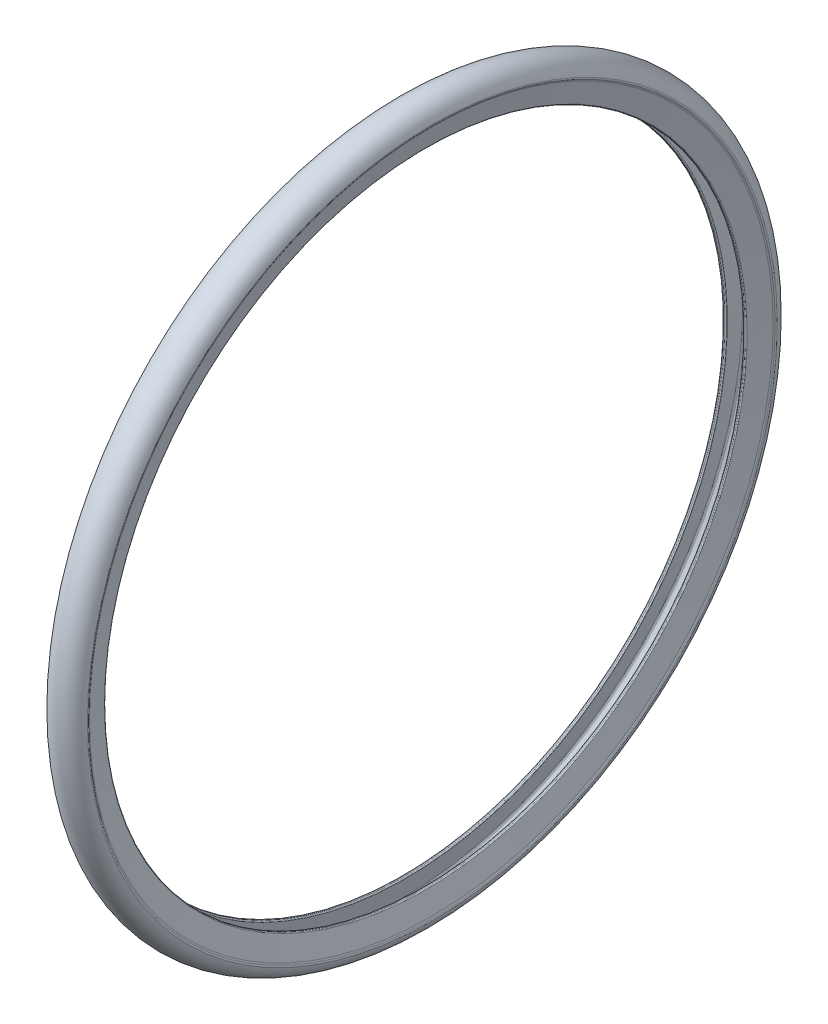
ISO-10303-21;
HEADER;
FILE_DESCRIPTION(('STEP AP214'),'2;1');
FILE_NAME('part.step','',(''),(''),'','','');
FILE_SCHEMA(('AUTOMOTIVE_DESIGN { 1 0 10303 214 1 1 1 1 }'));
ENDSEC;
DATA;
#1=APPLICATION_CONTEXT('core data for automotive mechanical design processes');
#2=APPLICATION_PROTOCOL_DEFINITION('international standard','automotive_design',2000,#1);
#3=PRODUCT_CONTEXT('',#1,'mechanical');
#4=PRODUCT('Part','Part','',(#3));
#5=PRODUCT_RELATED_PRODUCT_CATEGORY('part','',(#4));
#6=PRODUCT_DEFINITION_FORMATION('','',#4);
#7=PRODUCT_DEFINITION_CONTEXT('part definition',#1,'design');
#8=PRODUCT_DEFINITION('design','',#6,#7);
#9=PRODUCT_DEFINITION_SHAPE('','',#8);
#10=(LENGTH_UNIT() NAMED_UNIT(*) SI_UNIT(.MILLI.,.METRE.));
#11=(NAMED_UNIT(*) PLANE_ANGLE_UNIT() SI_UNIT($,.RADIAN.));
#12=(NAMED_UNIT(*) SI_UNIT($,.STERADIAN.) SOLID_ANGLE_UNIT());
#13=UNCERTAINTY_MEASURE_WITH_UNIT(LENGTH_MEASURE(1.E-05),#10,'distance_accuracy_value','');
#14=(GEOMETRIC_REPRESENTATION_CONTEXT(3) GLOBAL_UNCERTAINTY_ASSIGNED_CONTEXT((#13)) GLOBAL_UNIT_ASSIGNED_CONTEXT((#10,
#11,#12)) REPRESENTATION_CONTEXT('',''));
#15=CARTESIAN_POINT('',(0.,0.,0.));
#16=DIRECTION('',(0.,0.,1.));
#17=DIRECTION('',(1.,0.,0.));
#18=AXIS2_PLACEMENT_3D('',#15,#16,#17);
#19=CARTESIAN_POINT('',(0.891203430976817,-289.525905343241,-6.66133814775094E-13));
#20=DIRECTION('',(-1.,0.,0.));
#21=DIRECTION('',(0.,0.,1.));
#22=AXIS2_PLACEMENT_3D('',#19,#20,#21);
#23=TOROIDAL_SURFACE('',#22,303.142931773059,20.7636001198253);
#24=CARTESIAN_POINT('',(-12.4111606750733,-289.525905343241,-6.66133814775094E-13));
#25=DIRECTION('',(-1.,0.,0.));
#26=DIRECTION('',(0.,0.,1.));
#27=AXIS2_PLACEMENT_3D('',#24,#25,#26);
#28=CIRCLE('',#27,319.085773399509);
#29=CARTESIAN_POINT('',(-12.4111606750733,-289.525905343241,319.085773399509));
#30=VERTEX_POINT('',#29);
#31=EDGE_CURVE('E95',#30,#30,#28,.T.);
#32=ORIENTED_EDGE('',*,*,#31,.T.);
#33=EDGE_LOOP('',(#32));
#34=FACE_BOUND('',#33,.T.);
#35=CARTESIAN_POINT('',(12.5524141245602,-289.525905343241,-2.22044604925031E-13));
#36=DIRECTION('',(-1.,0.,0.));
#37=DIRECTION('',(0.,0.,1.));
#38=AXIS2_PLACEMENT_3D('',#35,#36,#37);
#39=CIRCLE('',#38,320.322665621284);
#40=CARTESIAN_POINT('',(12.5524141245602,-289.525905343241,320.322665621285));
#41=VERTEX_POINT('',#40);
#42=EDGE_CURVE('E10',#41,#41,#39,.T.);
#43=ORIENTED_EDGE('',*,*,#42,.F.);
#44=EDGE_LOOP('',(#43));
#45=FACE_BOUND('',#44,.T.);
#46=ADVANCED_FACE('F37',(#34,#45),#23,.F.);
#47=CARTESIAN_POINT('',(11.4291782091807,-289.525905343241,-4.44089209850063E-13));
#48=DIRECTION('',(-1.,0.,0.));
#49=DIRECTION('',(0.,0.,1.));
#50=AXIS2_PLACEMENT_3D('',#47,#48,#49);
#51=TOROIDAL_SURFACE('',#50,318.667872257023,2.00000000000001);
#52=CARTESIAN_POINT('',(13.3795560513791,-289.525905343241,-4.44089209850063E-13));
#53=DIRECTION('',(-1.,0.,0.));
#54=DIRECTION('',(0.,0.,1.));
#55=AXIS2_PLACEMENT_3D('',#52,#53,#54);
#56=CIRCLE('',#55,318.225123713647);
#57=CARTESIAN_POINT('',(13.3795560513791,-289.525905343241,318.225123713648));
#58=VERTEX_POINT('',#57);
#59=EDGE_CURVE('E43',#58,#58,#56,.T.);
#60=ORIENTED_EDGE('',*,*,#59,.F.);
#61=EDGE_LOOP('',(#60));
#62=FACE_BOUND('',#61,.T.);
#63=ORIENTED_EDGE('',*,*,#42,.T.);
#64=EDGE_LOOP('',(#63));
#65=FACE_BOUND('',#64,.T.);
#66=ADVANCED_FACE('F137',(#62,#65),#51,.F.);
#67=CARTESIAN_POINT('',(7.9191165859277,-289.525905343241,-6.66133814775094E-13));
#68=DIRECTION('',(1.,0.,0.));
#69=DIRECTION('',(0.,0.,-1.));
#70=AXIS2_PLACEMENT_3D('',#67,#68,#69);
#71=CONICAL_SURFACE('',#70,297.736876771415,1.31033488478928);
#72=ORIENTED_EDGE('',*,*,#59,.T.);
#73=EDGE_LOOP('',(#72));
#74=FACE_BOUND('',#73,.T.);
#75=CARTESIAN_POINT('',(7.9191165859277,-289.525905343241,-6.66133814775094E-13));
#76=DIRECTION('',(-1.,0.,0.));
#77=DIRECTION('',(0.,0.,1.));
#78=AXIS2_PLACEMENT_3D('',#75,#76,#77);
#79=CIRCLE('',#78,297.736876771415);
#80=CARTESIAN_POINT('',(7.91911658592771,-289.525905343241,297.736876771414));
#81=VERTEX_POINT('',#80);
#82=EDGE_CURVE('E47',#81,#81,#79,.T.);
#83=ORIENTED_EDGE('',*,*,#82,.F.);
#84=EDGE_LOOP('',(#83));
#85=FACE_BOUND('',#84,.T.);
#86=ADVANCED_FACE('F141',(#74,#85),#71,.T.);
#87=CARTESIAN_POINT('',(8.88538783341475,-289.525905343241,-6.66133814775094E-13));
#88=DIRECTION('',(-1.,0.,0.));
#89=DIRECTION('',(0.,0.,1.));
#90=AXIS2_PLACEMENT_3D('',#87,#88,#89);
#91=TOROIDAL_SURFACE('',#90,297.479350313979,0.999999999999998);
#92=ORIENTED_EDGE('',*,*,#82,.T.);
#93=EDGE_LOOP('',(#92));
#94=FACE_BOUND('',#93,.T.);
#95=CARTESIAN_POINT('',(8.88538783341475,-289.525905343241,-6.66133814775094E-13));
#96=DIRECTION('',(-1.,0.,0.));
#97=DIRECTION('',(0.,0.,1.));
#98=AXIS2_PLACEMENT_3D('',#95,#96,#97);
#99=CIRCLE('',#98,296.479350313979);
#100=CARTESIAN_POINT('',(8.88538783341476,-289.525905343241,296.479350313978));
#101=VERTEX_POINT('',#100);
#102=EDGE_CURVE('E51',#101,#101,#99,.T.);
#103=ORIENTED_EDGE('',*,*,#102,.F.);
#104=EDGE_LOOP('',(#103));
#105=FACE_BOUND('',#104,.T.);
#106=ADVANCED_FACE('F146',(#94,#105),#91,.T.);
#107=CARTESIAN_POINT('',(-43.1075930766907,-289.525905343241,0.));
#108=DIRECTION('',(-1.,0.,0.));
#109=DIRECTION('',(0.,0.,1.));
#110=AXIS2_PLACEMENT_3D('',#107,#108,#109);
#111=CYLINDRICAL_SURFACE('',#110,296.479350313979);
#112=ORIENTED_EDGE('',*,*,#102,.T.);
#113=EDGE_LOOP('',(#112));
#114=FACE_BOUND('',#113,.T.);
#115=CARTESIAN_POINT('',(9.92029392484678,-289.525905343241,-4.44089209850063E-13));
#116=DIRECTION('',(-1.,0.,0.));
#117=DIRECTION('',(0.,0.,1.));
#118=AXIS2_PLACEMENT_3D('',#115,#116,#117);
#119=CIRCLE('',#118,296.479350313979);
#120=CARTESIAN_POINT('',(9.92029392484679,-289.525905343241,296.479350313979));
#121=VERTEX_POINT('',#120);
#122=EDGE_CURVE('E56',#121,#121,#119,.T.);
#123=ORIENTED_EDGE('',*,*,#122,.F.);
#124=EDGE_LOOP('',(#123));
#125=FACE_BOUND('',#124,.T.);
#126=ADVANCED_FACE('F151',(#114,#125),#111,.F.);
#127=CARTESIAN_POINT('',(9.92029392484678,-289.525905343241,-4.44089209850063E-13));
#128=DIRECTION('',(-1.,0.,0.));
#129=DIRECTION('',(0.,0.,1.));
#130=AXIS2_PLACEMENT_3D('',#127,#128,#129);
#131=TOROIDAL_SURFACE('',#130,297.479350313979,0.999999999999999);
#132=CARTESIAN_POINT('',(10.8865651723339,-289.525905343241,-6.66133814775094E-13));
#133=DIRECTION('',(-1.,0.,0.));
#134=DIRECTION('',(0.,0.,1.));
#135=AXIS2_PLACEMENT_3D('',#132,#133,#134);
#136=CIRCLE('',#135,297.221823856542);
#137=CARTESIAN_POINT('',(10.8865651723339,-289.525905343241,297.221823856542));
#138=VERTEX_POINT('',#137);
#139=EDGE_CURVE('E59',#138,#138,#136,.T.);
#140=ORIENTED_EDGE('',*,*,#139,.F.);
#141=EDGE_LOOP('',(#140));
#142=FACE_BOUND('',#141,.T.);
#143=ORIENTED_EDGE('',*,*,#122,.T.);
#144=EDGE_LOOP('',(#143));
#145=FACE_BOUND('',#144,.T.);
#146=ADVANCED_FACE('F155',(#142,#145),#131,.T.);
#147=CARTESIAN_POINT('',(10.8865651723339,-289.525905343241,-6.66133814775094E-13));
#148=DIRECTION('',(1.,0.,0.));
#149=DIRECTION('',(0.,0.,-1.));
#150=AXIS2_PLACEMENT_3D('',#147,#148,#149);
#151=CONICAL_SURFACE('',#150,297.221823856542,1.31033488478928);
#152=CARTESIAN_POINT('',(15.927669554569,-289.525905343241,-2.22044604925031E-13));
#153=DIRECTION('',(-1.,0.,0.));
#154=DIRECTION('',(0.,0.,1.));
#155=AXIS2_PLACEMENT_3D('',#152,#153,#154);
#156=CIRCLE('',#155,316.136673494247);
#157=CARTESIAN_POINT('',(15.9276695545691,-289.525905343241,316.136673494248));
#158=VERTEX_POINT('',#157);
#159=EDGE_CURVE('E62',#158,#158,#156,.T.);
#160=ORIENTED_EDGE('',*,*,#159,.F.);
#161=EDGE_LOOP('',(#160));
#162=FACE_BOUND('',#161,.T.);
#163=ORIENTED_EDGE('',*,*,#139,.T.);
#164=EDGE_LOOP('',(#163));
#165=FACE_BOUND('',#164,.T.);
#166=ADVANCED_FACE('F159',(#162,#165),#151,.F.);
#167=CARTESIAN_POINT('',(19.4620725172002,-289.525905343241,-2.22044604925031E-13));
#168=DIRECTION('',(-1.,0.,0.));
#169=DIRECTION('',(0.,0.,1.));
#170=AXIS2_PLACEMENT_3D('',#167,#168,#169);
#171=TOROIDAL_SURFACE('',#170,315.194699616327,3.65777515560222);
#172=ORIENTED_EDGE('',*,*,#159,.T.);
#173=EDGE_LOOP('',(#172));
#174=FACE_BOUND('',#173,.T.);
#175=CARTESIAN_POINT('',(16.5920155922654,-289.525905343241,-2.22044604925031E-13));
#176=DIRECTION('',(-1.,0.,0.));
#177=DIRECTION('',(0.,0.,1.));
#178=AXIS2_PLACEMENT_3D('',#175,#176,#177);
#179=CIRCLE('',#178,317.462317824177);
#180=CARTESIAN_POINT('',(16.5920155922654,-289.525905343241,317.462317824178));
#181=VERTEX_POINT('',#180);
#182=EDGE_CURVE('E65',#181,#181,#179,.T.);
#183=ORIENTED_EDGE('',*,*,#182,.F.);
#184=EDGE_LOOP('',(#183));
#185=FACE_BOUND('',#184,.T.);
#186=ADVANCED_FACE('F163',(#174,#185),#171,.F.);
#187=CARTESIAN_POINT('',(15.1150014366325,-289.525905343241,-2.22044604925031E-13));
#188=DIRECTION('',(-1.,0.,0.));
#189=DIRECTION('',(0.,0.,1.));
#190=AXIS2_PLACEMENT_3D('',#187,#188,#189);
#191=TOROIDAL_SURFACE('',#190,318.629299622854,1.88239669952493);
#192=ORIENTED_EDGE('',*,*,#182,.T.);
#193=EDGE_LOOP('',(#192));
#194=FACE_BOUND('',#193,.T.);
#195=CARTESIAN_POINT('',(16.9454746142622,-289.525905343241,-8.88178419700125E-13));
#196=DIRECTION('',(-1.,0.,0.));
#197=DIRECTION('',(0.,0.,1.));
#198=AXIS2_PLACEMENT_3D('',#195,#196,#197);
#199=CIRCLE('',#198,319.068372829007);
#200=CARTESIAN_POINT('',(16.9454746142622,-289.525905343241,319.068372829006));
#201=VERTEX_POINT('',#200);
#202=EDGE_CURVE('E68',#201,#201,#199,.T.);
#203=ORIENTED_EDGE('',*,*,#202,.F.);
#204=EDGE_LOOP('',(#203));
#205=FACE_BOUND('',#204,.T.);
#206=ADVANCED_FACE('F167',(#194,#205),#191,.T.);
#207=CARTESIAN_POINT('',(-1.11022302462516E-13,-289.525905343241,-6.66133814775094E-13));
#208=DIRECTION('',(-1.,0.,0.));
#209=DIRECTION('',(0.,0.,1.));
#210=AXIS2_PLACEMENT_3D('',#207,#208,#209);
#211=TOROIDAL_SURFACE('',#210,315.003684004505,17.4261529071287);
#212=CARTESIAN_POINT('',(-16.9454746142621,-289.525905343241,0.));
#213=DIRECTION('',(-1.,0.,0.));
#214=DIRECTION('',(0.,0.,1.));
#215=AXIS2_PLACEMENT_3D('',#212,#213,#214);
#216=CIRCLE('',#215,319.068372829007);
#217=CARTESIAN_POINT('',(-16.9454746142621,-289.525905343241,319.068372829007));
#218=VERTEX_POINT('',#217);
#219=EDGE_CURVE('E71',#218,#218,#216,.T.);
#220=ORIENTED_EDGE('',*,*,#219,.F.);
#221=EDGE_LOOP('',(#220));
#222=FACE_BOUND('',#221,.T.);
#223=ORIENTED_EDGE('',*,*,#202,.T.);
#224=EDGE_LOOP('',(#223));
#225=FACE_BOUND('',#224,.T.);
#226=ADVANCED_FACE('F171',(#222,#225),#211,.T.);
#227=CARTESIAN_POINT('',(-15.1150014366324,-289.525905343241,0.));
#228=DIRECTION('',(-1.,0.,0.));
#229=DIRECTION('',(0.,0.,1.));
#230=AXIS2_PLACEMENT_3D('',#227,#228,#229);
#231=TOROIDAL_SURFACE('',#230,318.629299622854,1.88239669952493);
#232=CARTESIAN_POINT('',(-16.5920155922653,-289.525905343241,-6.66133814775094E-13));
#233=DIRECTION('',(-1.,0.,0.));
#234=DIRECTION('',(0.,0.,1.));
#235=AXIS2_PLACEMENT_3D('',#232,#233,#234);
#236=CIRCLE('',#235,317.462317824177);
#237=CARTESIAN_POINT('',(-16.5920155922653,-289.525905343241,317.462317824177));
#238=VERTEX_POINT('',#237);
#239=EDGE_CURVE('E74',#238,#238,#236,.T.);
#240=ORIENTED_EDGE('',*,*,#239,.F.);
#241=EDGE_LOOP('',(#240));
#242=FACE_BOUND('',#241,.T.);
#243=ORIENTED_EDGE('',*,*,#219,.T.);
#244=EDGE_LOOP('',(#243));
#245=FACE_BOUND('',#244,.T.);
#246=ADVANCED_FACE('F175',(#242,#245),#231,.T.);
#247=CARTESIAN_POINT('',(-19.4620725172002,-289.525905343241,-2.22044604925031E-13));
#248=DIRECTION('',(-1.,0.,0.));
#249=DIRECTION('',(0.,0.,1.));
#250=AXIS2_PLACEMENT_3D('',#247,#248,#249);
#251=TOROIDAL_SURFACE('',#250,315.194699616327,3.65777515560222);
#252=CARTESIAN_POINT('',(-15.927669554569,-289.525905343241,-4.44089209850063E-13));
#253=DIRECTION('',(-1.,0.,0.));
#254=DIRECTION('',(0.,0.,1.));
#255=AXIS2_PLACEMENT_3D('',#252,#253,#254);
#256=CIRCLE('',#255,316.136673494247);
#257=CARTESIAN_POINT('',(-15.927669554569,-289.525905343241,316.136673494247));
#258=VERTEX_POINT('',#257);
#259=EDGE_CURVE('E77',#258,#258,#256,.T.);
#260=ORIENTED_EDGE('',*,*,#259,.F.);
#261=EDGE_LOOP('',(#260));
#262=FACE_BOUND('',#261,.T.);
#263=ORIENTED_EDGE('',*,*,#239,.T.);
#264=EDGE_LOOP('',(#263));
#265=FACE_BOUND('',#264,.T.);
#266=ADVANCED_FACE('F133',(#262,#265),#251,.F.);
#267=CARTESIAN_POINT('',(-10.8865651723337,-289.525905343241,4.44089209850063E-13));
#268=DIRECTION('',(-1.,0.,0.));
#269=DIRECTION('',(0.,0.,1.));
#270=AXIS2_PLACEMENT_3D('',#267,#268,#269);
#271=CONICAL_SURFACE('',#270,297.221823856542,1.31033488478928);
#272=ORIENTED_EDGE('',*,*,#259,.T.);
#273=EDGE_LOOP('',(#272));
#274=FACE_BOUND('',#273,.T.);
#275=CARTESIAN_POINT('',(-10.8865651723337,-289.525905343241,4.44089209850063E-13));
#276=DIRECTION('',(-1.,0.,0.));
#277=DIRECTION('',(0.,0.,1.));
#278=AXIS2_PLACEMENT_3D('',#275,#276,#277);
#279=CIRCLE('',#278,297.221823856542);
#280=CARTESIAN_POINT('',(-10.8865651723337,-289.525905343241,297.221823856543));
#281=VERTEX_POINT('',#280);
#282=EDGE_CURVE('E80',#281,#281,#279,.T.);
#283=ORIENTED_EDGE('',*,*,#282,.F.);
#284=EDGE_LOOP('',(#283));
#285=FACE_BOUND('',#284,.T.);
#286=ADVANCED_FACE('F127',(#274,#285),#271,.F.);
#287=CARTESIAN_POINT('',(-9.92029392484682,-289.525905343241,-6.66133814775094E-13));
#288=DIRECTION('',(-1.,0.,0.));
#289=DIRECTION('',(0.,0.,1.));
#290=AXIS2_PLACEMENT_3D('',#287,#288,#289);
#291=TOROIDAL_SURFACE('',#290,297.479350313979,0.999999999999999);
#292=ORIENTED_EDGE('',*,*,#282,.T.);
#293=EDGE_LOOP('',(#292));
#294=FACE_BOUND('',#293,.T.);
#295=CARTESIAN_POINT('',(-9.92029392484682,-289.525905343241,-6.66133814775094E-13));
#296=DIRECTION('',(-1.,0.,0.));
#297=DIRECTION('',(0.,0.,1.));
#298=AXIS2_PLACEMENT_3D('',#295,#296,#297);
#299=CIRCLE('',#298,296.479350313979);
#300=CARTESIAN_POINT('',(-9.92029392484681,-289.525905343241,296.479350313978));
#301=VERTEX_POINT('',#300);
#302=EDGE_CURVE('E83',#301,#301,#299,.T.);
#303=ORIENTED_EDGE('',*,*,#302,.F.);
#304=EDGE_LOOP('',(#303));
#305=FACE_BOUND('',#304,.T.);
#306=ADVANCED_FACE('F122',(#294,#305),#291,.T.);
#307=CARTESIAN_POINT('',(-43.1075930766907,-289.525905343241,0.));
#308=DIRECTION('',(-1.,0.,0.));
#309=DIRECTION('',(0.,0.,1.));
#310=AXIS2_PLACEMENT_3D('',#307,#308,#309);
#311=CYLINDRICAL_SURFACE('',#310,296.479350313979);
#312=CARTESIAN_POINT('',(-8.88538783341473,-289.525905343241,-2.22044604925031E-13));
#313=DIRECTION('',(-1.,0.,0.));
#314=DIRECTION('',(0.,0.,1.));
#315=AXIS2_PLACEMENT_3D('',#312,#313,#314);
#316=CIRCLE('',#315,296.479350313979);
#317=CARTESIAN_POINT('',(-8.88538783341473,-289.525905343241,296.479350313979));
#318=VERTEX_POINT('',#317);
#319=EDGE_CURVE('E86',#318,#318,#316,.T.);
#320=ORIENTED_EDGE('',*,*,#319,.F.);
#321=EDGE_LOOP('',(#320));
#322=FACE_BOUND('',#321,.T.);
#323=ORIENTED_EDGE('',*,*,#302,.T.);
#324=EDGE_LOOP('',(#323));
#325=FACE_BOUND('',#324,.T.);
#326=ADVANCED_FACE('F116',(#322,#325),#311,.F.);
#327=CARTESIAN_POINT('',(-8.88538783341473,-289.525905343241,-2.22044604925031E-13));
#328=DIRECTION('',(-1.,0.,0.));
#329=DIRECTION('',(0.,0.,1.));
#330=AXIS2_PLACEMENT_3D('',#327,#328,#329);
#331=TOROIDAL_SURFACE('',#330,297.479350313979,0.999999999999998);
#332=CARTESIAN_POINT('',(-7.9191165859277,-289.525905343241,-2.22044604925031E-13));
#333=DIRECTION('',(-1.,0.,0.));
#334=DIRECTION('',(0.,0.,1.));
#335=AXIS2_PLACEMENT_3D('',#332,#333,#334);
#336=CIRCLE('',#335,297.736876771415);
#337=CARTESIAN_POINT('',(-7.91911658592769,-289.525905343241,297.736876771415));
#338=VERTEX_POINT('',#337);
#339=EDGE_CURVE('E89',#338,#338,#336,.T.);
#340=ORIENTED_EDGE('',*,*,#339,.F.);
#341=EDGE_LOOP('',(#340));
#342=FACE_BOUND('',#341,.T.);
#343=ORIENTED_EDGE('',*,*,#319,.T.);
#344=EDGE_LOOP('',(#343));
#345=FACE_BOUND('',#344,.T.);
#346=ADVANCED_FACE('F110',(#342,#345),#331,.T.);
#347=CARTESIAN_POINT('',(-7.9191165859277,-289.525905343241,-2.22044604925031E-13));
#348=DIRECTION('',(-1.,0.,0.));
#349=DIRECTION('',(0.,0.,1.));
#350=AXIS2_PLACEMENT_3D('',#347,#348,#349);
#351=CONICAL_SURFACE('',#350,297.736876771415,1.31033488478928);
#352=CARTESIAN_POINT('',(-13.0623874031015,-289.525905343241,-6.66133814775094E-13));
#353=DIRECTION('',(-1.,0.,0.));
#354=DIRECTION('',(0.,0.,1.));
#355=AXIS2_PLACEMENT_3D('',#352,#353,#354);
#356=CIRCLE('',#355,317.03506755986);
#357=CARTESIAN_POINT('',(-13.0623874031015,-289.525905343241,317.03506755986));
#358=VERTEX_POINT('',#357);
#359=EDGE_CURVE('E92',#358,#358,#356,.T.);
#360=ORIENTED_EDGE('',*,*,#359,.F.);
#361=EDGE_LOOP('',(#360));
#362=FACE_BOUND('',#361,.T.);
#363=ORIENTED_EDGE('',*,*,#339,.T.);
#364=EDGE_LOOP('',(#363));
#365=FACE_BOUND('',#364,.T.);
#366=ADVANCED_FACE('F104',(#362,#365),#351,.T.);
#367=CARTESIAN_POINT('',(-11.1298449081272,-289.525905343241,-4.44089209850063E-13));
#368=DIRECTION('',(-1.,0.,0.));
#369=DIRECTION('',(0.,0.,1.));
#370=AXIS2_PLACEMENT_3D('',#367,#368,#369);
#371=TOROIDAL_SURFACE('',#370,317.550120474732,2.);
#372=ORIENTED_EDGE('',*,*,#31,.F.);
#373=EDGE_LOOP('',(#372));
#374=FACE_BOUND('',#373,.T.);
#375=ORIENTED_EDGE('',*,*,#359,.T.);
#376=EDGE_LOOP('',(#375));
#377=FACE_BOUND('',#376,.T.);
#378=ADVANCED_FACE('F101',(#374,#377),#371,.F.);
#379=CLOSED_SHELL('',(#46,#66,#86,#106,#126,#146,#166,#186,#206,#226,#246,#266,#286,#306,#326,
#346,#366,#378));
#380=MANIFOLD_SOLID_BREP('B2',#379);
#381=ADVANCED_BREP_SHAPE_REPRESENTATION('',(#18,#380),#14);
#382=SHAPE_DEFINITION_REPRESENTATION(#9,#381);
ENDSEC;
END-ISO-10303-21;
